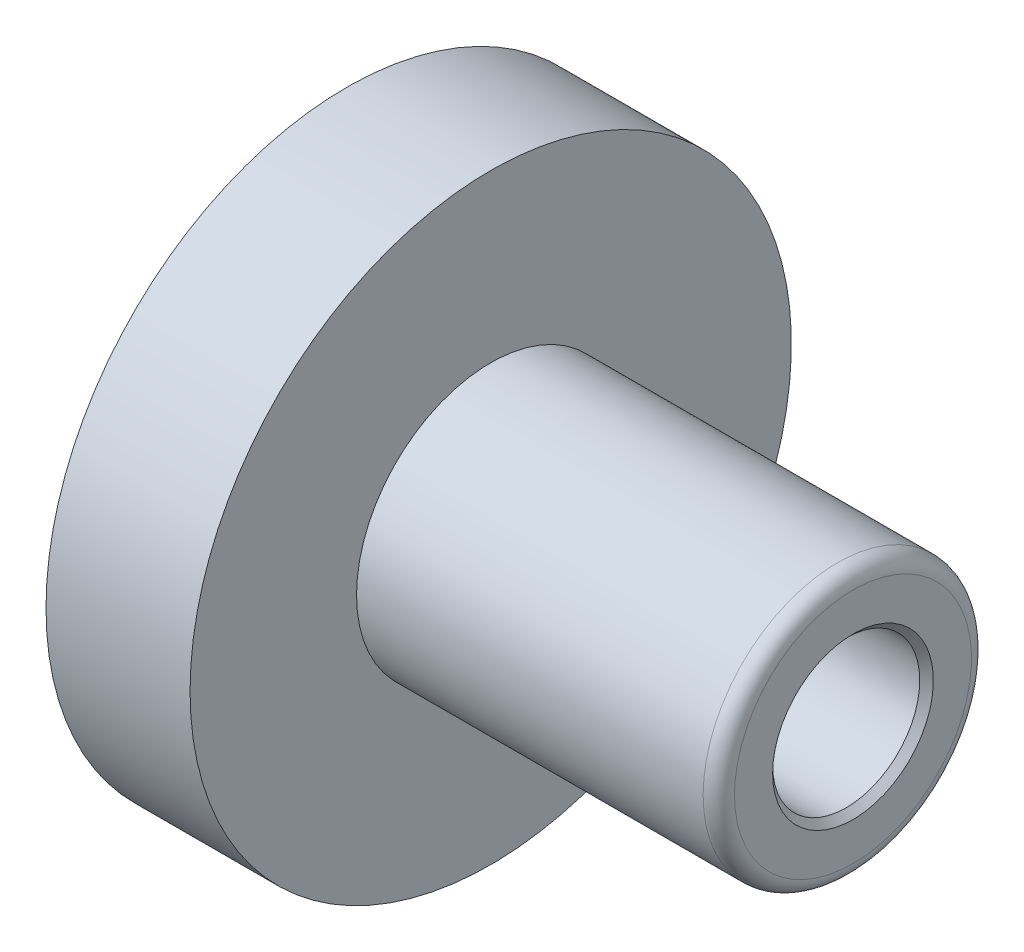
ISO-10303-21;
HEADER;
FILE_DESCRIPTION(('STEP AP214'),'2;1');
FILE_NAME('part.step','',(''),(''),'','','');
FILE_SCHEMA(('AUTOMOTIVE_DESIGN { 1 0 10303 214 1 1 1 1 }'));
ENDSEC;
DATA;
#1=APPLICATION_CONTEXT('core data for automotive mechanical design processes');
#2=APPLICATION_PROTOCOL_DEFINITION('international standard','automotive_design',2000,#1);
#3=PRODUCT_CONTEXT('',#1,'mechanical');
#4=PRODUCT('Part','Part','',(#3));
#5=PRODUCT_RELATED_PRODUCT_CATEGORY('part','',(#4));
#6=PRODUCT_DEFINITION_FORMATION('','',#4);
#7=PRODUCT_DEFINITION_CONTEXT('part definition',#1,'design');
#8=PRODUCT_DEFINITION('design','',#6,#7);
#9=PRODUCT_DEFINITION_SHAPE('','',#8);
#10=(LENGTH_UNIT() NAMED_UNIT(*) SI_UNIT(.MILLI.,.METRE.));
#11=(NAMED_UNIT(*) PLANE_ANGLE_UNIT() SI_UNIT($,.RADIAN.));
#12=(NAMED_UNIT(*) SI_UNIT($,.STERADIAN.) SOLID_ANGLE_UNIT());
#13=UNCERTAINTY_MEASURE_WITH_UNIT(LENGTH_MEASURE(1.E-05),#10,'distance_accuracy_value','');
#14=(GEOMETRIC_REPRESENTATION_CONTEXT(3) GLOBAL_UNCERTAINTY_ASSIGNED_CONTEXT((#13)) GLOBAL_UNIT_ASSIGNED_CONTEXT((#10,
#11,#12)) REPRESENTATION_CONTEXT('',''));
#15=CARTESIAN_POINT('',(0.,0.,0.));
#16=DIRECTION('',(0.,0.,1.));
#17=DIRECTION('',(1.,0.,0.));
#18=AXIS2_PLACEMENT_3D('',#15,#16,#17);
#19=CARTESIAN_POINT('',(0.,0.,0.));
#20=DIRECTION('',(-1.,0.,0.));
#21=DIRECTION('',(0.,0.,1.));
#22=AXIS2_PLACEMENT_3D('',#19,#20,#21);
#23=CYLINDRICAL_SURFACE('',#22,9.906);
#24=CARTESIAN_POINT('',(30.9372,0.,0.));
#25=DIRECTION('',(-1.,0.,0.));
#26=DIRECTION('',(0.,0.,1.));
#27=AXIS2_PLACEMENT_3D('',#24,#25,#26);
#28=CIRCLE('',#27,9.906);
#29=CARTESIAN_POINT('',(30.9372,0.,9.906));
#30=VERTEX_POINT('',#29);
#31=EDGE_CURVE('E42',#30,#30,#28,.T.);
#32=ORIENTED_EDGE('',*,*,#31,.F.);
#33=EDGE_LOOP('',(#32));
#34=FACE_BOUND('',#33,.T.);
#35=CARTESIAN_POINT('',(0.,0.,0.));
#36=DIRECTION('',(-1.,0.,0.));
#37=DIRECTION('',(0.,0.,1.));
#38=AXIS2_PLACEMENT_3D('',#35,#36,#37);
#39=CIRCLE('',#38,9.906);
#40=CARTESIAN_POINT('',(0.,0.,9.906));
#41=VERTEX_POINT('',#40);
#42=EDGE_CURVE('E63',#41,#41,#39,.T.);
#43=ORIENTED_EDGE('',*,*,#42,.T.);
#44=EDGE_LOOP('',(#43));
#45=FACE_BOUND('',#44,.T.);
#46=ADVANCED_FACE('F31',(#34,#45),#23,.F.);
#47=CARTESIAN_POINT('',(30.9372,9.906,0.));
#48=DIRECTION('',(1.,0.,0.));
#49=DIRECTION('',(0.,0.,-1.));
#50=AXIS2_PLACEMENT_3D('',#47,#48,#49);
#51=PLANE('',#50);
#52=CARTESIAN_POINT('',(30.9372,0.,0.));
#53=DIRECTION('',(1.,0.,0.));
#54=DIRECTION('',(0.,0.,-1.));
#55=AXIS2_PLACEMENT_3D('',#52,#53,#54);
#56=CIRCLE('',#55,7.3787);
#57=CARTESIAN_POINT('',(30.9372,0.,-7.3787));
#58=VERTEX_POINT('',#57);
#59=EDGE_CURVE('E76',#58,#58,#56,.T.);
#60=ORIENTED_EDGE('',*,*,#59,.T.);
#61=EDGE_LOOP('',(#60));
#62=FACE_BOUND('',#61,.T.);
#63=ORIENTED_EDGE('',*,*,#31,.T.);
#64=EDGE_LOOP('',(#63));
#65=FACE_BOUND('',#64,.T.);
#66=ADVANCED_FACE('F82',(#62,#65),#51,.F.);
#67=CARTESIAN_POINT('',(50.8,11.8872,0.));
#68=DIRECTION('',(-1.,0.,0.));
#69=DIRECTION('',(0.,0.,1.));
#70=AXIS2_PLACEMENT_3D('',#67,#68,#69);
#71=PLANE('',#70);
#72=CARTESIAN_POINT('',(50.8,0.,0.));
#73=DIRECTION('',(-1.,0.,0.));
#74=DIRECTION('',(0.,0.,1.));
#75=AXIS2_PLACEMENT_3D('',#72,#73,#74);
#76=CIRCLE('',#75,8.06450000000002);
#77=CARTESIAN_POINT('',(50.8,0.,8.06450000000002));
#78=VERTEX_POINT('',#77);
#79=EDGE_CURVE('E10',#78,#78,#76,.T.);
#80=ORIENTED_EDGE('',*,*,#79,.T.);
#81=EDGE_LOOP('',(#80));
#82=FACE_BOUND('',#81,.T.);
#83=CARTESIAN_POINT('',(50.8,0.,0.));
#84=DIRECTION('',(-1.,0.,0.));
#85=DIRECTION('',(0.,0.,1.));
#86=AXIS2_PLACEMENT_3D('',#83,#84,#85);
#87=CIRCLE('',#86,11.8872);
#88=CARTESIAN_POINT('',(50.8,0.,11.8872));
#89=VERTEX_POINT('',#88);
#90=EDGE_CURVE('E46',#89,#89,#87,.T.);
#91=ORIENTED_EDGE('',*,*,#90,.F.);
#92=EDGE_LOOP('',(#91));
#93=FACE_BOUND('',#92,.T.);
#94=ADVANCED_FACE('F102',(#82,#93),#71,.F.);
#95=CARTESIAN_POINT('',(49.2252,0.,0.));
#96=DIRECTION('',(-1.,0.,0.));
#97=DIRECTION('',(0.,0.,1.));
#98=AXIS2_PLACEMENT_3D('',#95,#96,#97);
#99=TOROIDAL_SURFACE('',#98,11.8872,1.5748);
#100=CARTESIAN_POINT('',(49.2252,0.,0.));
#101=DIRECTION('',(-1.,0.,0.));
#102=DIRECTION('',(0.,0.,1.));
#103=AXIS2_PLACEMENT_3D('',#100,#101,#102);
#104=CIRCLE('',#103,13.462);
#105=CARTESIAN_POINT('',(49.2252,0.,13.462));
#106=VERTEX_POINT('',#105);
#107=EDGE_CURVE('E51',#106,#106,#104,.T.);
#108=ORIENTED_EDGE('',*,*,#107,.F.);
#109=EDGE_LOOP('',(#108));
#110=FACE_BOUND('',#109,.T.);
#111=ORIENTED_EDGE('',*,*,#90,.T.);
#112=EDGE_LOOP('',(#111));
#113=FACE_BOUND('',#112,.T.);
#114=ADVANCED_FACE('F109',(#110,#113),#99,.T.);
#115=CARTESIAN_POINT('',(0.,0.,0.));
#116=DIRECTION('',(-1.,0.,0.));
#117=DIRECTION('',(0.,0.,1.));
#118=AXIS2_PLACEMENT_3D('',#115,#116,#117);
#119=CYLINDRICAL_SURFACE('',#118,13.462);
#120=CARTESIAN_POINT('',(14.4526,0.,0.));
#121=DIRECTION('',(-1.,0.,0.));
#122=DIRECTION('',(0.,0.,1.));
#123=AXIS2_PLACEMENT_3D('',#120,#121,#122);
#124=CIRCLE('',#123,13.462);
#125=CARTESIAN_POINT('',(14.4526,0.,13.462));
#126=VERTEX_POINT('',#125);
#127=EDGE_CURVE('E54',#126,#126,#124,.T.);
#128=ORIENTED_EDGE('',*,*,#127,.F.);
#129=EDGE_LOOP('',(#128));
#130=FACE_BOUND('',#129,.T.);
#131=ORIENTED_EDGE('',*,*,#107,.T.);
#132=EDGE_LOOP('',(#131));
#133=FACE_BOUND('',#132,.T.);
#134=ADVANCED_FACE('F112',(#130,#133),#119,.T.);
#135=CARTESIAN_POINT('',(14.4526,30.1625,0.));
#136=DIRECTION('',(-1.,0.,0.));
#137=DIRECTION('',(0.,0.,1.));
#138=AXIS2_PLACEMENT_3D('',#135,#136,#137);
#139=PLANE('',#138);
#140=CARTESIAN_POINT('',(14.4526,0.,0.));
#141=DIRECTION('',(-1.,0.,0.));
#142=DIRECTION('',(0.,0.,1.));
#143=AXIS2_PLACEMENT_3D('',#140,#141,#142);
#144=CIRCLE('',#143,30.1625);
#145=CARTESIAN_POINT('',(14.4526,0.,30.1625));
#146=VERTEX_POINT('',#145);
#147=EDGE_CURVE('E57',#146,#146,#144,.T.);
#148=ORIENTED_EDGE('',*,*,#147,.F.);
#149=EDGE_LOOP('',(#148));
#150=FACE_BOUND('',#149,.T.);
#151=ORIENTED_EDGE('',*,*,#127,.T.);
#152=EDGE_LOOP('',(#151));
#153=FACE_BOUND('',#152,.T.);
#154=ADVANCED_FACE('F116',(#150,#153),#139,.F.);
#155=CARTESIAN_POINT('',(0.,0.,0.));
#156=DIRECTION('',(-1.,0.,0.));
#157=DIRECTION('',(0.,0.,1.));
#158=AXIS2_PLACEMENT_3D('',#155,#156,#157);
#159=CYLINDRICAL_SURFACE('',#158,30.1625);
#160=CARTESIAN_POINT('',(0.,0.,0.));
#161=DIRECTION('',(-1.,0.,0.));
#162=DIRECTION('',(0.,0.,1.));
#163=AXIS2_PLACEMENT_3D('',#160,#161,#162);
#164=CIRCLE('',#163,30.1625);
#165=CARTESIAN_POINT('',(0.,0.,30.1625));
#166=VERTEX_POINT('',#165);
#167=EDGE_CURVE('E60',#166,#166,#164,.T.);
#168=ORIENTED_EDGE('',*,*,#167,.F.);
#169=EDGE_LOOP('',(#168));
#170=FACE_BOUND('',#169,.T.);
#171=ORIENTED_EDGE('',*,*,#147,.T.);
#172=EDGE_LOOP('',(#171));
#173=FACE_BOUND('',#172,.T.);
#174=ADVANCED_FACE('F120',(#170,#173),#159,.T.);
#175=CARTESIAN_POINT('',(0.,9.906,0.));
#176=DIRECTION('',(1.,0.,0.));
#177=DIRECTION('',(0.,0.,-1.));
#178=AXIS2_PLACEMENT_3D('',#175,#176,#177);
#179=PLANE('',#178);
#180=CARTESIAN_POINT('',(0.,0.,19.939));
#181=DIRECTION('',(-1.,0.,0.));
#182=DIRECTION('',(0.,0.,-1.));
#183=AXIS2_PLACEMENT_3D('',#180,#181,#182);
#184=CIRCLE('',#183,3.2004);
#185=CARTESIAN_POINT('',(0.,0.,16.7386));
#186=VERTEX_POINT('',#185);
#187=EDGE_CURVE('E73',#186,#186,#184,.T.);
#188=ORIENTED_EDGE('',*,*,#187,.F.);
#189=EDGE_LOOP('',(#188));
#190=FACE_BOUND('',#189,.T.);
#191=CARTESIAN_POINT('',(0.,0.,-19.939));
#192=DIRECTION('',(-1.,0.,0.));
#193=DIRECTION('',(0.,0.,1.));
#194=AXIS2_PLACEMENT_3D('',#191,#192,#193);
#195=CIRCLE('',#194,3.2004);
#196=CARTESIAN_POINT('',(0.,0.,-16.7386));
#197=VERTEX_POINT('',#196);
#198=EDGE_CURVE('E67',#197,#197,#195,.T.);
#199=ORIENTED_EDGE('',*,*,#198,.F.);
#200=EDGE_LOOP('',(#199));
#201=FACE_BOUND('',#200,.T.);
#202=ORIENTED_EDGE('',*,*,#42,.F.);
#203=EDGE_LOOP('',(#202));
#204=FACE_BOUND('',#203,.T.);
#205=ORIENTED_EDGE('',*,*,#167,.T.);
#206=EDGE_LOOP('',(#205));
#207=FACE_BOUND('',#206,.T.);
#208=ADVANCED_FACE('F124',(#190,#201,#204,#207),#179,.F.);
#209=CARTESIAN_POINT('',(7.9502,0.,-19.939));
#210=DIRECTION('',(-1.,0.,0.));
#211=DIRECTION('',(0.,0.,1.));
#212=AXIS2_PLACEMENT_3D('',#209,#210,#211);
#213=CYLINDRICAL_SURFACE('',#212,3.2004);
#214=CARTESIAN_POINT('',(7.9502,0.,-19.939));
#215=DIRECTION('',(-1.,0.,0.));
#216=DIRECTION('',(0.,0.,1.));
#217=AXIS2_PLACEMENT_3D('',#214,#215,#216);
#218=CIRCLE('',#217,3.2004);
#219=CARTESIAN_POINT('',(7.9502,0.,-16.7386));
#220=VERTEX_POINT('',#219);
#221=EDGE_CURVE('E66',#220,#220,#218,.T.);
#222=ORIENTED_EDGE('',*,*,#221,.F.);
#223=EDGE_LOOP('',(#222));
#224=FACE_BOUND('',#223,.T.);
#225=ORIENTED_EDGE('',*,*,#198,.T.);
#226=EDGE_LOOP('',(#225));
#227=FACE_BOUND('',#226,.T.);
#228=ADVANCED_FACE('F128',(#224,#227),#213,.F.);
#229=CARTESIAN_POINT('',(7.9502,0.,-19.939));
#230=DIRECTION('',(-1.,0.,0.));
#231=DIRECTION('',(0.,0.,1.));
#232=AXIS2_PLACEMENT_3D('',#229,#230,#231);
#233=PLANE('',#232);
#234=ORIENTED_EDGE('',*,*,#221,.T.);
#235=EDGE_LOOP('',(#234));
#236=FACE_BOUND('',#235,.T.);
#237=ADVANCED_FACE('F132',(#236),#233,.T.);
#238=CARTESIAN_POINT('',(7.9502,0.,19.939));
#239=DIRECTION('',(-1.,0.,0.));
#240=DIRECTION('',(0.,0.,1.));
#241=AXIS2_PLACEMENT_3D('',#238,#239,#240);
#242=CYLINDRICAL_SURFACE('',#241,3.2004);
#243=CARTESIAN_POINT('',(7.9502,0.,19.939));
#244=DIRECTION('',(-1.,0.,0.));
#245=DIRECTION('',(0.,0.,-1.));
#246=AXIS2_PLACEMENT_3D('',#243,#244,#245);
#247=CIRCLE('',#246,3.2004);
#248=CARTESIAN_POINT('',(7.9502,0.,16.7386));
#249=VERTEX_POINT('',#248);
#250=EDGE_CURVE('E70',#249,#249,#247,.T.);
#251=ORIENTED_EDGE('',*,*,#250,.F.);
#252=EDGE_LOOP('',(#251));
#253=FACE_BOUND('',#252,.T.);
#254=ORIENTED_EDGE('',*,*,#187,.T.);
#255=EDGE_LOOP('',(#254));
#256=FACE_BOUND('',#255,.T.);
#257=ADVANCED_FACE('F94',(#253,#256),#242,.F.);
#258=CARTESIAN_POINT('',(7.9502,0.,19.939));
#259=DIRECTION('',(1.,0.,0.));
#260=DIRECTION('',(0.,0.,-1.));
#261=AXIS2_PLACEMENT_3D('',#258,#259,#260);
#262=PLANE('',#261);
#263=ORIENTED_EDGE('',*,*,#250,.T.);
#264=EDGE_LOOP('',(#263));
#265=FACE_BOUND('',#264,.T.);
#266=ADVANCED_FACE('F87',(#265),#262,.F.);
#267=CARTESIAN_POINT('',(0.,0.,0.));
#268=DIRECTION('',(1.,0.,0.));
#269=DIRECTION('',(0.,0.,-1.));
#270=AXIS2_PLACEMENT_3D('',#267,#268,#269);
#271=CYLINDRICAL_SURFACE('',#270,7.3787);
#272=CARTESIAN_POINT('',(50.1142,0.,0.));
#273=DIRECTION('',(-1.,0.,0.));
#274=DIRECTION('',(0.,0.,1.));
#275=AXIS2_PLACEMENT_3D('',#272,#273,#274);
#276=CIRCLE('',#275,7.3787);
#277=CARTESIAN_POINT('',(50.1142,0.,7.3787));
#278=VERTEX_POINT('',#277);
#279=EDGE_CURVE('E38',#278,#278,#276,.F.);
#280=ORIENTED_EDGE('',*,*,#279,.T.);
#281=EDGE_LOOP('',(#280));
#282=FACE_BOUND('',#281,.T.);
#283=ORIENTED_EDGE('',*,*,#59,.F.);
#284=EDGE_LOOP('',(#283));
#285=FACE_BOUND('',#284,.T.);
#286=ADVANCED_FACE('F85',(#282,#285),#271,.F.);
#287=CARTESIAN_POINT('',(50.1142,0.,0.));
#288=DIRECTION('',(1.,0.,0.));
#289=DIRECTION('',(0.,0.,-1.));
#290=AXIS2_PLACEMENT_3D('',#287,#288,#289);
#291=CONICAL_SURFACE('',#290,7.3787,0.78539816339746);
#292=ORIENTED_EDGE('',*,*,#79,.F.);
#293=EDGE_LOOP('',(#292));
#294=FACE_BOUND('',#293,.T.);
#295=ORIENTED_EDGE('',*,*,#279,.F.);
#296=EDGE_LOOP('',(#295));
#297=FACE_BOUND('',#296,.T.);
#298=ADVANCED_FACE('F33',(#294,#297),#291,.F.);
#299=CLOSED_SHELL('',(#46,#66,#94,#114,#134,#154,#174,#208,#228,#237,#257,#266,#286,#298));
#300=MANIFOLD_SOLID_BREP('B2',#299);
#301=ADVANCED_BREP_SHAPE_REPRESENTATION('',(#18,#300),#14);
#302=SHAPE_DEFINITION_REPRESENTATION(#9,#301);
ENDSEC;
END-ISO-10303-21;
